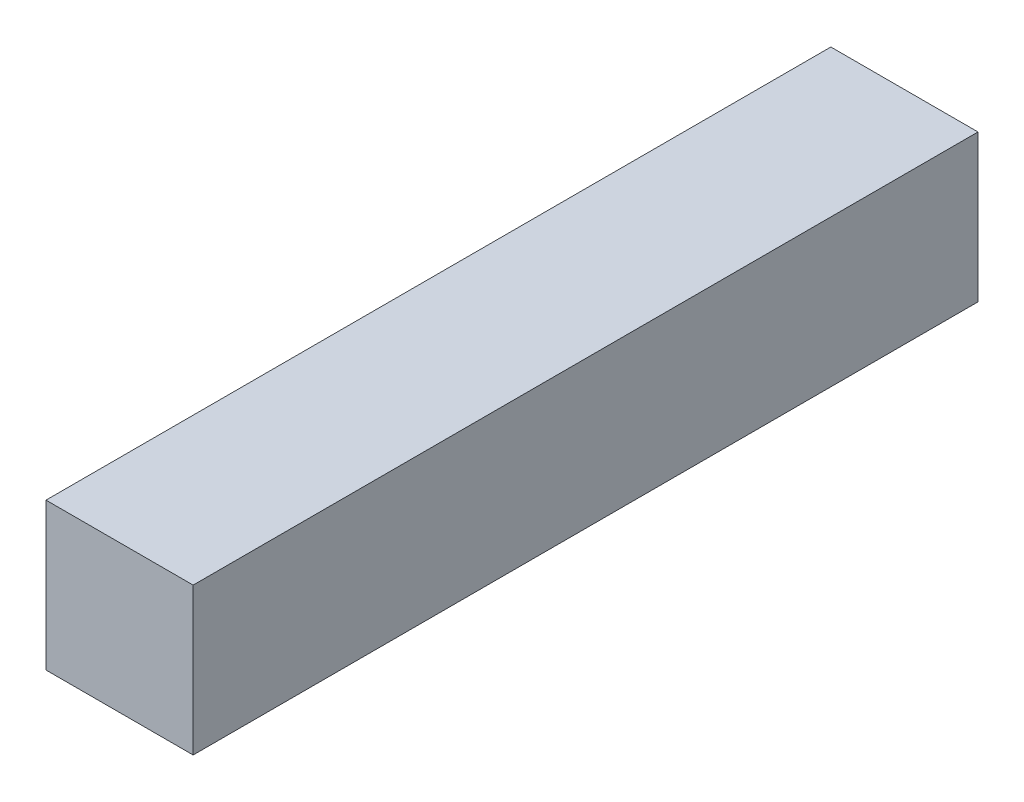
ISO-10303-21;
HEADER;
FILE_DESCRIPTION(('STEP AP214'),'2;1');
FILE_NAME('part.step','',(''),(''),'','','');
FILE_SCHEMA(('AUTOMOTIVE_DESIGN { 1 0 10303 214 1 1 1 1 }'));
ENDSEC;
DATA;
#1=APPLICATION_CONTEXT('core data for automotive mechanical design processes');
#2=APPLICATION_PROTOCOL_DEFINITION('international standard','automotive_design',2000,#1);
#3=PRODUCT_CONTEXT('',#1,'mechanical');
#4=PRODUCT('Part','Part','',(#3));
#5=PRODUCT_RELATED_PRODUCT_CATEGORY('part','',(#4));
#6=PRODUCT_DEFINITION_FORMATION('','',#4);
#7=PRODUCT_DEFINITION_CONTEXT('part definition',#1,'design');
#8=PRODUCT_DEFINITION('design','',#6,#7);
#9=PRODUCT_DEFINITION_SHAPE('','',#8);
#10=(LENGTH_UNIT() NAMED_UNIT(*) SI_UNIT(.MILLI.,.METRE.));
#11=(NAMED_UNIT(*) PLANE_ANGLE_UNIT() SI_UNIT($,.RADIAN.));
#12=(NAMED_UNIT(*) SI_UNIT($,.STERADIAN.) SOLID_ANGLE_UNIT());
#13=UNCERTAINTY_MEASURE_WITH_UNIT(LENGTH_MEASURE(1.E-05),#10,'distance_accuracy_value','');
#14=(GEOMETRIC_REPRESENTATION_CONTEXT(3) GLOBAL_UNCERTAINTY_ASSIGNED_CONTEXT((#13)) GLOBAL_UNIT_ASSIGNED_CONTEXT((#10,
#11,#12)) REPRESENTATION_CONTEXT('',''));
#15=CARTESIAN_POINT('',(0.,0.,0.));
#16=DIRECTION('',(0.,0.,1.));
#17=DIRECTION('',(1.,0.,0.));
#18=AXIS2_PLACEMENT_3D('',#15,#16,#17);
#19=CARTESIAN_POINT('',(2.38125,2.38125,25.4));
#20=DIRECTION('',(-1.,0.,0.));
#21=DIRECTION('',(0.,0.,1.));
#22=AXIS2_PLACEMENT_3D('',#19,#20,#21);
#23=PLANE('',#22);
#24=DIRECTION('',(0.,1.,0.));
#25=VECTOR('',#24,1.);
#26=CARTESIAN_POINT('',(2.38125,2.38125,0.));
#27=LINE('',#26,#25);
#28=CARTESIAN_POINT('',(2.38125,-2.38125,0.));
#29=VERTEX_POINT('',#28);
#30=CARTESIAN_POINT('',(2.38125,2.38125,0.));
#31=VERTEX_POINT('',#30);
#32=EDGE_CURVE('E95',#29,#31,#27,.T.);
#33=ORIENTED_EDGE('',*,*,#32,.T.);
#34=DIRECTION('',(0.,0.,-1.));
#35=VECTOR('',#34,1.);
#36=CARTESIAN_POINT('',(2.38125,2.38125,25.4));
#37=LINE('',#36,#35);
#38=CARTESIAN_POINT('',(2.38125,2.38125,25.4));
#39=VERTEX_POINT('',#38);
#40=EDGE_CURVE('E11',#39,#31,#37,.T.);
#41=ORIENTED_EDGE('',*,*,#40,.F.);
#42=DIRECTION('',(0.,1.,0.));
#43=VECTOR('',#42,1.);
#44=CARTESIAN_POINT('',(2.38125,2.38125,25.4));
#45=LINE('',#44,#43);
#46=CARTESIAN_POINT('',(2.38125,-2.38125,25.4));
#47=VERTEX_POINT('',#46);
#48=EDGE_CURVE('E83',#47,#39,#45,.T.);
#49=ORIENTED_EDGE('',*,*,#48,.F.);
#50=DIRECTION('',(0.,0.,-1.));
#51=VECTOR('',#50,1.);
#52=CARTESIAN_POINT('',(2.38125,-2.38125,25.4));
#53=LINE('',#52,#51);
#54=EDGE_CURVE('E91',#47,#29,#53,.T.);
#55=ORIENTED_EDGE('',*,*,#54,.T.);
#56=EDGE_LOOP('',(#33,#41,#49,#55));
#57=FACE_BOUND('',#56,.T.);
#58=ADVANCED_FACE('F32',(#57),#23,.F.);
#59=CARTESIAN_POINT('',(-2.38125,2.38125,25.4));
#60=DIRECTION('',(0.,-1.,0.));
#61=DIRECTION('',(0.,0.,-1.));
#62=AXIS2_PLACEMENT_3D('',#59,#60,#61);
#63=PLANE('',#62);
#64=DIRECTION('',(-1.,0.,0.));
#65=VECTOR('',#64,1.);
#66=CARTESIAN_POINT('',(-2.38125,2.38125,0.));
#67=LINE('',#66,#65);
#68=CARTESIAN_POINT('',(-2.38125,2.38125,0.));
#69=VERTEX_POINT('',#68);
#70=EDGE_CURVE('E87',#31,#69,#67,.T.);
#71=ORIENTED_EDGE('',*,*,#70,.T.);
#72=DIRECTION('',(0.,0.,-1.));
#73=VECTOR('',#72,1.);
#74=CARTESIAN_POINT('',(-2.38125,2.38125,25.4));
#75=LINE('',#74,#73);
#76=CARTESIAN_POINT('',(-2.38125,2.38125,25.4));
#77=VERTEX_POINT('',#76);
#78=EDGE_CURVE('E40',#77,#69,#75,.T.);
#79=ORIENTED_EDGE('',*,*,#78,.F.);
#80=DIRECTION('',(-1.,0.,0.));
#81=VECTOR('',#80,1.);
#82=CARTESIAN_POINT('',(-2.38125,2.38125,25.4));
#83=LINE('',#82,#81);
#84=EDGE_CURVE('E78',#39,#77,#83,.T.);
#85=ORIENTED_EDGE('',*,*,#84,.F.);
#86=ORIENTED_EDGE('',*,*,#40,.T.);
#87=EDGE_LOOP('',(#71,#79,#85,#86));
#88=FACE_BOUND('',#87,.T.);
#89=ADVANCED_FACE('F86',(#88),#63,.F.);
#90=CARTESIAN_POINT('',(-2.38125,2.38125,25.4));
#91=DIRECTION('',(1.,0.,0.));
#92=DIRECTION('',(0.,0.,-1.));
#93=AXIS2_PLACEMENT_3D('',#90,#91,#92);
#94=PLANE('',#93);
#95=DIRECTION('',(0.,-1.,0.));
#96=VECTOR('',#95,1.);
#97=CARTESIAN_POINT('',(-2.38125,2.38125,0.));
#98=LINE('',#97,#96);
#99=CARTESIAN_POINT('',(-2.38125,-2.38125,0.));
#100=VERTEX_POINT('',#99);
#101=EDGE_CURVE('E65',#69,#100,#98,.T.);
#102=ORIENTED_EDGE('',*,*,#101,.T.);
#103=DIRECTION('',(0.,0.,-1.));
#104=VECTOR('',#103,1.);
#105=CARTESIAN_POINT('',(-2.38125,-2.38125,25.4));
#106=LINE('',#105,#104);
#107=CARTESIAN_POINT('',(-2.38125,-2.38125,25.4));
#108=VERTEX_POINT('',#107);
#109=EDGE_CURVE('E88',#108,#100,#106,.T.);
#110=ORIENTED_EDGE('',*,*,#109,.F.);
#111=DIRECTION('',(0.,-1.,0.));
#112=VECTOR('',#111,1.);
#113=CARTESIAN_POINT('',(-2.38125,2.38125,25.4));
#114=LINE('',#113,#112);
#115=EDGE_CURVE('E81',#77,#108,#114,.T.);
#116=ORIENTED_EDGE('',*,*,#115,.F.);
#117=ORIENTED_EDGE('',*,*,#78,.T.);
#118=EDGE_LOOP('',(#102,#110,#116,#117));
#119=FACE_BOUND('',#118,.T.);
#120=ADVANCED_FACE('F89',(#119),#94,.F.);
#121=CARTESIAN_POINT('',(-2.38125,-2.38125,25.4));
#122=DIRECTION('',(0.,1.,0.));
#123=DIRECTION('',(0.,0.,1.));
#124=AXIS2_PLACEMENT_3D('',#121,#122,#123);
#125=PLANE('',#124);
#126=DIRECTION('',(1.,0.,0.));
#127=VECTOR('',#126,1.);
#128=CARTESIAN_POINT('',(-2.38125,-2.38125,0.));
#129=LINE('',#128,#127);
#130=EDGE_CURVE('E71',#100,#29,#129,.T.);
#131=ORIENTED_EDGE('',*,*,#130,.T.);
#132=ORIENTED_EDGE('',*,*,#54,.F.);
#133=DIRECTION('',(1.,0.,0.));
#134=VECTOR('',#133,1.);
#135=CARTESIAN_POINT('',(-2.38125,-2.38125,25.4));
#136=LINE('',#135,#134);
#137=EDGE_CURVE('E48',#108,#47,#136,.T.);
#138=ORIENTED_EDGE('',*,*,#137,.F.);
#139=ORIENTED_EDGE('',*,*,#109,.T.);
#140=EDGE_LOOP('',(#131,#132,#138,#139));
#141=FACE_BOUND('',#140,.T.);
#142=ADVANCED_FACE('F102',(#141),#125,.F.);
#143=CARTESIAN_POINT('',(2.38125,-2.38125,25.4));
#144=DIRECTION('',(0.,0.,1.));
#145=DIRECTION('',(1.,0.,0.));
#146=AXIS2_PLACEMENT_3D('',#143,#144,#145);
#147=PLANE('',#146);
#148=ORIENTED_EDGE('',*,*,#48,.T.);
#149=ORIENTED_EDGE('',*,*,#84,.T.);
#150=ORIENTED_EDGE('',*,*,#115,.T.);
#151=ORIENTED_EDGE('',*,*,#137,.T.);
#152=EDGE_LOOP('',(#148,#149,#150,#151));
#153=FACE_BOUND('',#152,.T.);
#154=ADVANCED_FACE('F79',(#153),#147,.T.);
#155=CARTESIAN_POINT('',(2.38125,-2.38125,0.));
#156=DIRECTION('',(0.,0.,1.));
#157=DIRECTION('',(1.,0.,0.));
#158=AXIS2_PLACEMENT_3D('',#155,#156,#157);
#159=PLANE('',#158);
#160=ORIENTED_EDGE('',*,*,#32,.F.);
#161=ORIENTED_EDGE('',*,*,#130,.F.);
#162=ORIENTED_EDGE('',*,*,#101,.F.);
#163=ORIENTED_EDGE('',*,*,#70,.F.);
#164=EDGE_LOOP('',(#160,#161,#162,#163));
#165=FACE_BOUND('',#164,.T.);
#166=ADVANCED_FACE('F105',(#165),#159,.F.);
#167=CLOSED_SHELL('',(#58,#89,#120,#142,#154,#166));
#168=MANIFOLD_SOLID_BREP('B2',#167);
#169=ADVANCED_BREP_SHAPE_REPRESENTATION('',(#18,#168),#14);
#170=SHAPE_DEFINITION_REPRESENTATION(#9,#169);
ENDSEC;
END-ISO-10303-21;
